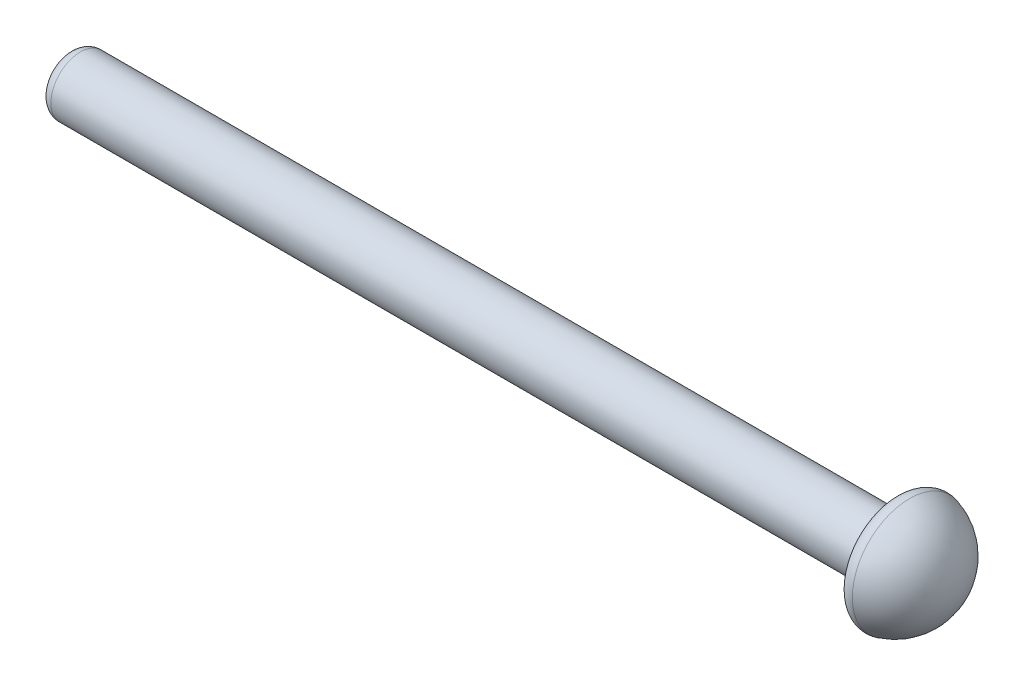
from build123d import *

# Parameters (mm, degrees)
FILLET_1_R = 0.2


with BuildPart() as part:
    # Sketch 1 → Revolve 1 (revolve)
    with BuildSketch(Plane.XY, mode=Mode.PRIVATE) as revolve_1_sk:
        with BuildLine():
            Line((-7.5, 0), (7.5, 0))
            ThreePointArc((7.5, 0), (7.207106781, 0.707106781), (6.5, 1))
            Line((6.5, 1), (6.5, 0.5))
            Line((6.5, 0.5), (-7.5, 0.5))
            Line((-7.5, 0.5), (-7.5, 0))
        make_face()
    revolve(revolve_1_sk.sketch.rotate(Axis((-7.5, 0, 0), (1, 0, 0)), 180), axis=Axis((-7.5, 0, 0), (1, 0, 0)))

    # Fillet 1
    fillet_1_edges = [part.edges().sort_by_distance(p)[0] for p in [
        (-7.5, 0.5, 0),
        (6.5, 1, 0),
    ]]
    fillet(fillet_1_edges, radius=FILLET_1_R)


solid = part.part
